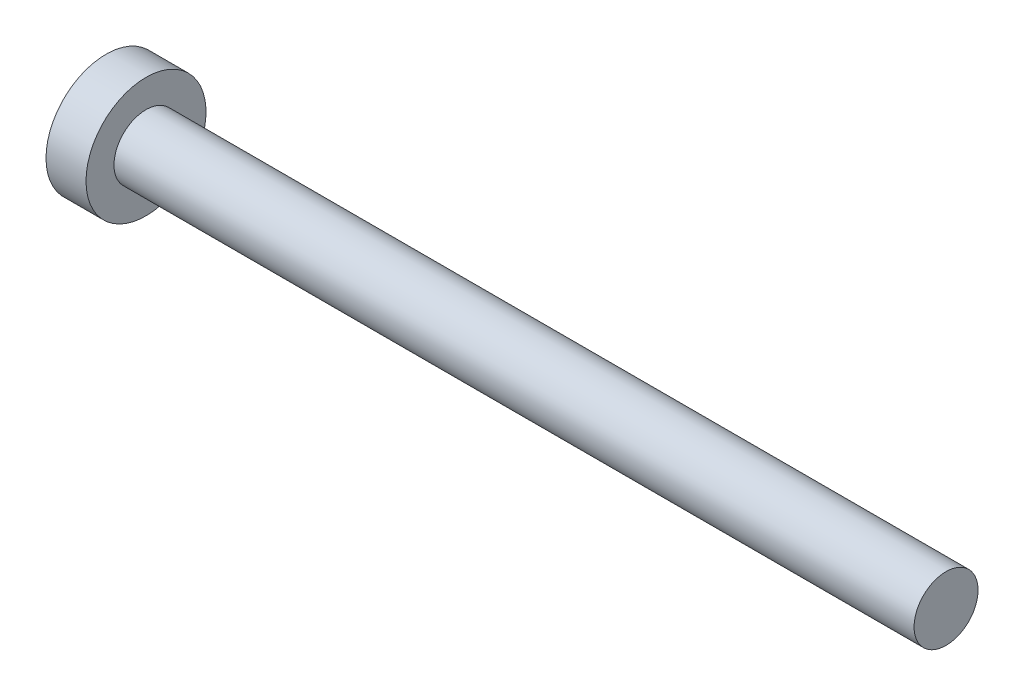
from build123d import *


with BuildPart() as part:
    # Esquisse1 → R_volution1 (revolve)
    with BuildSketch(Plane.XY, mode=Mode.PRIVATE) as r_volution1_sk:
        Polygon((-41.835674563, 0), (-41.835674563, 15), (-31.835674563, 15), (-31.835674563, 8), (168.164325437, 8), (168.164325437, 0), align=None)
    revolve(r_volution1_sk.sketch.rotate(Axis((-59.273579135, 0, 0), (1, 0, 0)), 90), axis=Axis((-59.273579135, 0, 0), (1, 0, 0)))


solid = part.part
